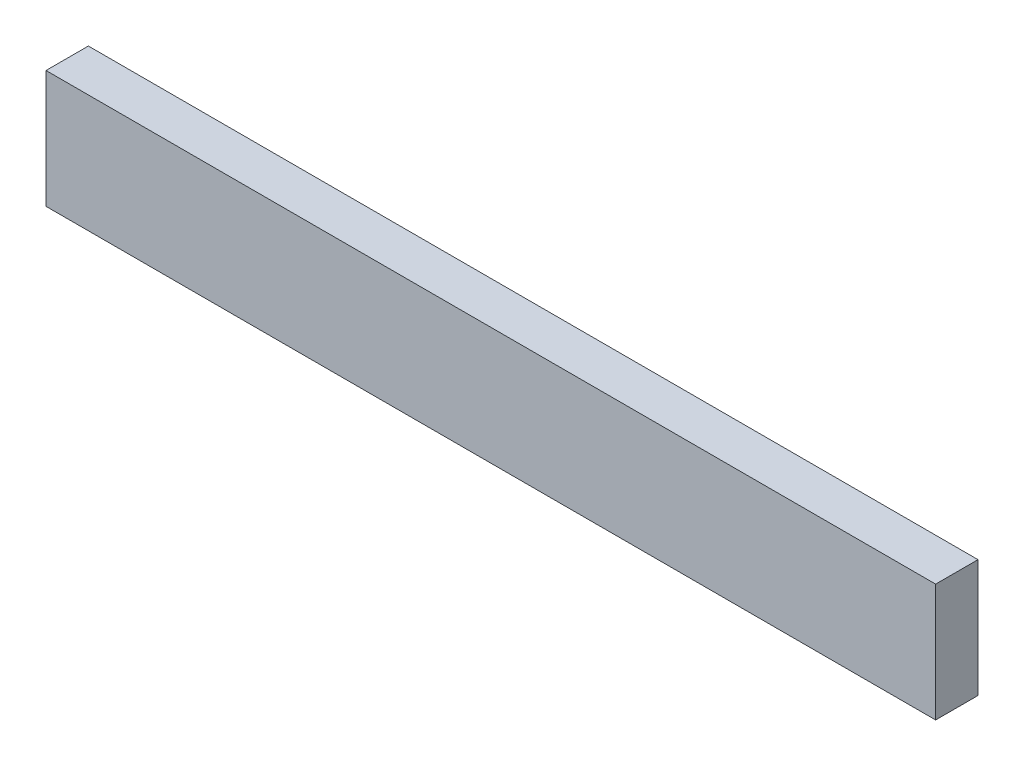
ISO-10303-21;
HEADER;
FILE_DESCRIPTION(('STEP AP214'),'2;1');
FILE_NAME('part.step','',(''),(''),'','','');
FILE_SCHEMA(('AUTOMOTIVE_DESIGN { 1 0 10303 214 1 1 1 1 }'));
ENDSEC;
DATA;
#1=APPLICATION_CONTEXT('core data for automotive mechanical design processes');
#2=APPLICATION_PROTOCOL_DEFINITION('international standard','automotive_design',2000,#1);
#3=PRODUCT_CONTEXT('',#1,'mechanical');
#4=PRODUCT('Part','Part','',(#3));
#5=PRODUCT_RELATED_PRODUCT_CATEGORY('part','',(#4));
#6=PRODUCT_DEFINITION_FORMATION('','',#4);
#7=PRODUCT_DEFINITION_CONTEXT('part definition',#1,'design');
#8=PRODUCT_DEFINITION('design','',#6,#7);
#9=PRODUCT_DEFINITION_SHAPE('','',#8);
#10=(LENGTH_UNIT() NAMED_UNIT(*) SI_UNIT(.MILLI.,.METRE.));
#11=(NAMED_UNIT(*) PLANE_ANGLE_UNIT() SI_UNIT($,.RADIAN.));
#12=(NAMED_UNIT(*) SI_UNIT($,.STERADIAN.) SOLID_ANGLE_UNIT());
#13=UNCERTAINTY_MEASURE_WITH_UNIT(LENGTH_MEASURE(1.E-05),#10,'distance_accuracy_value','');
#14=(GEOMETRIC_REPRESENTATION_CONTEXT(3) GLOBAL_UNCERTAINTY_ASSIGNED_CONTEXT((#13)) GLOBAL_UNIT_ASSIGNED_CONTEXT((#10,
#11,#12)) REPRESENTATION_CONTEXT('',''));
#15=CARTESIAN_POINT('',(0.,0.,0.));
#16=DIRECTION('',(0.,0.,1.));
#17=DIRECTION('',(1.,0.,0.));
#18=AXIS2_PLACEMENT_3D('',#15,#16,#17);
#19=CARTESIAN_POINT('',(189.,-25.,18.));
#20=DIRECTION('',(-1.,0.,0.));
#21=DIRECTION('',(0.,0.,1.));
#22=AXIS2_PLACEMENT_3D('',#19,#20,#21);
#23=PLANE('',#22);
#24=DIRECTION('',(0.,1.,0.));
#25=VECTOR('',#24,1.);
#26=CARTESIAN_POINT('',(189.,-25.,0.));
#27=LINE('',#26,#25);
#28=CARTESIAN_POINT('',(189.,-25.,0.));
#29=VERTEX_POINT('',#28);
#30=CARTESIAN_POINT('',(189.,25.,0.));
#31=VERTEX_POINT('',#30);
#32=EDGE_CURVE('E96',#29,#31,#27,.T.);
#33=ORIENTED_EDGE('',*,*,#32,.T.);
#34=DIRECTION('',(0.,0.,-1.));
#35=VECTOR('',#34,1.);
#36=CARTESIAN_POINT('',(189.,25.,18.));
#37=LINE('',#36,#35);
#38=CARTESIAN_POINT('',(189.,25.,18.));
#39=VERTEX_POINT('',#38);
#40=EDGE_CURVE('E11',#39,#31,#37,.T.);
#41=ORIENTED_EDGE('',*,*,#40,.F.);
#42=DIRECTION('',(0.,1.,0.));
#43=VECTOR('',#42,1.);
#44=CARTESIAN_POINT('',(189.,-25.,18.));
#45=LINE('',#44,#43);
#46=CARTESIAN_POINT('',(189.,-25.,18.));
#47=VERTEX_POINT('',#46);
#48=EDGE_CURVE('E84',#47,#39,#45,.T.);
#49=ORIENTED_EDGE('',*,*,#48,.F.);
#50=DIRECTION('',(0.,0.,-1.));
#51=VECTOR('',#50,1.);
#52=CARTESIAN_POINT('',(189.,-25.,18.));
#53=LINE('',#52,#51);
#54=EDGE_CURVE('E92',#47,#29,#53,.T.);
#55=ORIENTED_EDGE('',*,*,#54,.T.);
#56=EDGE_LOOP('',(#33,#41,#49,#55));
#57=FACE_BOUND('',#56,.T.);
#58=ADVANCED_FACE('F33',(#57),#23,.F.);
#59=CARTESIAN_POINT('',(-189.,25.,18.));
#60=DIRECTION('',(0.,-1.,0.));
#61=DIRECTION('',(0.,0.,-1.));
#62=AXIS2_PLACEMENT_3D('',#59,#60,#61);
#63=PLANE('',#62);
#64=DIRECTION('',(-1.,0.,0.));
#65=VECTOR('',#64,1.);
#66=CARTESIAN_POINT('',(-189.,25.,0.));
#67=LINE('',#66,#65);
#68=CARTESIAN_POINT('',(-189.,25.,0.));
#69=VERTEX_POINT('',#68);
#70=EDGE_CURVE('E88',#31,#69,#67,.T.);
#71=ORIENTED_EDGE('',*,*,#70,.T.);
#72=DIRECTION('',(0.,0.,-1.));
#73=VECTOR('',#72,1.);
#74=CARTESIAN_POINT('',(-189.,25.,18.));
#75=LINE('',#74,#73);
#76=CARTESIAN_POINT('',(-189.,25.,18.));
#77=VERTEX_POINT('',#76);
#78=EDGE_CURVE('E41',#77,#69,#75,.T.);
#79=ORIENTED_EDGE('',*,*,#78,.F.);
#80=DIRECTION('',(-1.,0.,0.));
#81=VECTOR('',#80,1.);
#82=CARTESIAN_POINT('',(-189.,25.,18.));
#83=LINE('',#82,#81);
#84=EDGE_CURVE('E79',#39,#77,#83,.T.);
#85=ORIENTED_EDGE('',*,*,#84,.F.);
#86=ORIENTED_EDGE('',*,*,#40,.T.);
#87=EDGE_LOOP('',(#71,#79,#85,#86));
#88=FACE_BOUND('',#87,.T.);
#89=ADVANCED_FACE('F87',(#88),#63,.F.);
#90=CARTESIAN_POINT('',(-189.,-25.,18.));
#91=DIRECTION('',(1.,0.,0.));
#92=DIRECTION('',(0.,0.,-1.));
#93=AXIS2_PLACEMENT_3D('',#90,#91,#92);
#94=PLANE('',#93);
#95=DIRECTION('',(0.,-1.,0.));
#96=VECTOR('',#95,1.);
#97=CARTESIAN_POINT('',(-189.,-25.,0.));
#98=LINE('',#97,#96);
#99=CARTESIAN_POINT('',(-189.,-25.,0.));
#100=VERTEX_POINT('',#99);
#101=EDGE_CURVE('E66',#69,#100,#98,.T.);
#102=ORIENTED_EDGE('',*,*,#101,.T.);
#103=DIRECTION('',(0.,0.,-1.));
#104=VECTOR('',#103,1.);
#105=CARTESIAN_POINT('',(-189.,-25.,18.));
#106=LINE('',#105,#104);
#107=CARTESIAN_POINT('',(-189.,-25.,18.));
#108=VERTEX_POINT('',#107);
#109=EDGE_CURVE('E89',#108,#100,#106,.T.);
#110=ORIENTED_EDGE('',*,*,#109,.F.);
#111=DIRECTION('',(0.,-1.,0.));
#112=VECTOR('',#111,1.);
#113=CARTESIAN_POINT('',(-189.,-25.,18.));
#114=LINE('',#113,#112);
#115=EDGE_CURVE('E82',#77,#108,#114,.T.);
#116=ORIENTED_EDGE('',*,*,#115,.F.);
#117=ORIENTED_EDGE('',*,*,#78,.T.);
#118=EDGE_LOOP('',(#102,#110,#116,#117));
#119=FACE_BOUND('',#118,.T.);
#120=ADVANCED_FACE('F90',(#119),#94,.F.);
#121=CARTESIAN_POINT('',(-189.,-25.,18.));
#122=DIRECTION('',(0.,1.,0.));
#123=DIRECTION('',(0.,0.,1.));
#124=AXIS2_PLACEMENT_3D('',#121,#122,#123);
#125=PLANE('',#124);
#126=DIRECTION('',(1.,0.,0.));
#127=VECTOR('',#126,1.);
#128=CARTESIAN_POINT('',(-189.,-25.,0.));
#129=LINE('',#128,#127);
#130=EDGE_CURVE('E72',#100,#29,#129,.T.);
#131=ORIENTED_EDGE('',*,*,#130,.T.);
#132=ORIENTED_EDGE('',*,*,#54,.F.);
#133=DIRECTION('',(1.,0.,0.));
#134=VECTOR('',#133,1.);
#135=CARTESIAN_POINT('',(-189.,-25.,18.));
#136=LINE('',#135,#134);
#137=EDGE_CURVE('E49',#108,#47,#136,.T.);
#138=ORIENTED_EDGE('',*,*,#137,.F.);
#139=ORIENTED_EDGE('',*,*,#109,.T.);
#140=EDGE_LOOP('',(#131,#132,#138,#139));
#141=FACE_BOUND('',#140,.T.);
#142=ADVANCED_FACE('F103',(#141),#125,.F.);
#143=CARTESIAN_POINT('',(0.,0.,18.));
#144=DIRECTION('',(0.,0.,-1.));
#145=DIRECTION('',(-1.,0.,0.));
#146=AXIS2_PLACEMENT_3D('',#143,#144,#145);
#147=PLANE('',#146);
#148=ORIENTED_EDGE('',*,*,#48,.T.);
#149=ORIENTED_EDGE('',*,*,#84,.T.);
#150=ORIENTED_EDGE('',*,*,#115,.T.);
#151=ORIENTED_EDGE('',*,*,#137,.T.);
#152=EDGE_LOOP('',(#148,#149,#150,#151));
#153=FACE_BOUND('',#152,.T.);
#154=ADVANCED_FACE('F80',(#153),#147,.F.);
#155=CARTESIAN_POINT('',(0.,0.,0.));
#156=DIRECTION('',(0.,0.,-1.));
#157=DIRECTION('',(-1.,0.,0.));
#158=AXIS2_PLACEMENT_3D('',#155,#156,#157);
#159=PLANE('',#158);
#160=ORIENTED_EDGE('',*,*,#32,.F.);
#161=ORIENTED_EDGE('',*,*,#130,.F.);
#162=ORIENTED_EDGE('',*,*,#101,.F.);
#163=ORIENTED_EDGE('',*,*,#70,.F.);
#164=EDGE_LOOP('',(#160,#161,#162,#163));
#165=FACE_BOUND('',#164,.T.);
#166=ADVANCED_FACE('F106',(#165),#159,.T.);
#167=CLOSED_SHELL('',(#58,#89,#120,#142,#154,#166));
#168=MANIFOLD_SOLID_BREP('B2',#167);
#169=ADVANCED_BREP_SHAPE_REPRESENTATION('',(#18,#168),#14);
#170=SHAPE_DEFINITION_REPRESENTATION(#9,#169);
ENDSEC;
END-ISO-10303-21;
